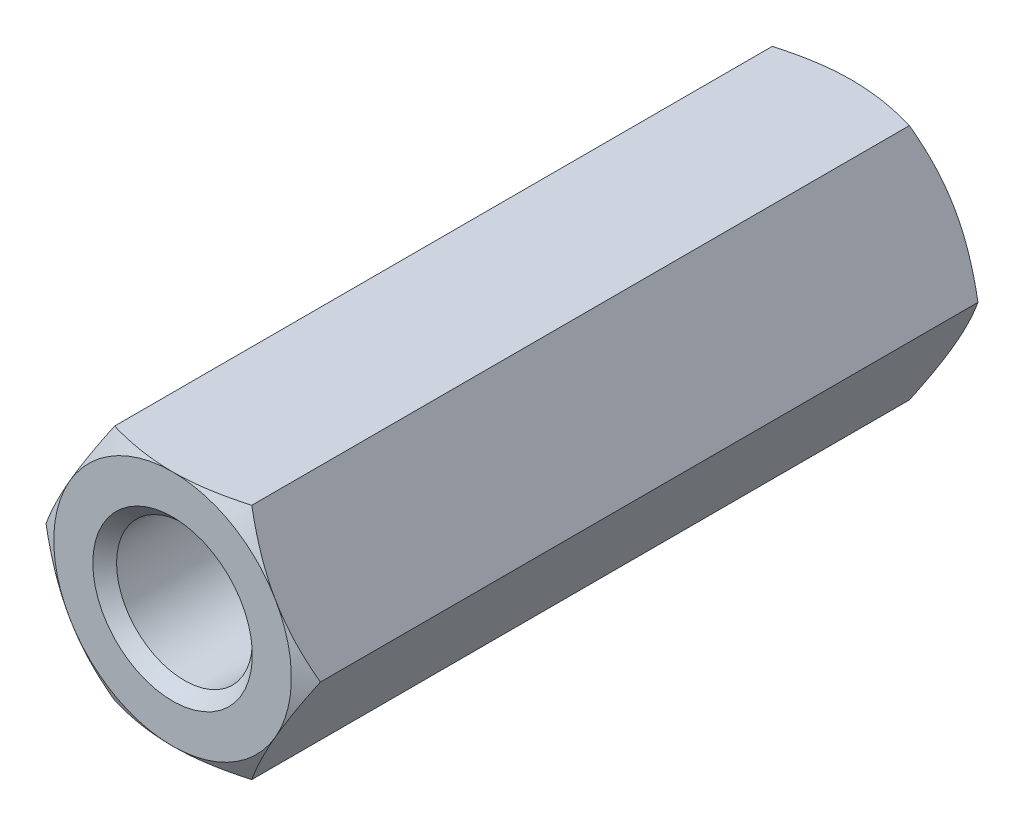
ISO-10303-21;
HEADER;
FILE_DESCRIPTION(('STEP AP214'),'2;1');
FILE_NAME('part.step','',(''),(''),'','','');
FILE_SCHEMA(('AUTOMOTIVE_DESIGN { 1 0 10303 214 1 1 1 1 }'));
ENDSEC;
DATA;
#1=APPLICATION_CONTEXT('core data for automotive mechanical design processes');
#2=APPLICATION_PROTOCOL_DEFINITION('international standard','automotive_design',2000,#1);
#3=PRODUCT_CONTEXT('',#1,'mechanical');
#4=PRODUCT('Part','Part','',(#3));
#5=PRODUCT_RELATED_PRODUCT_CATEGORY('part','',(#4));
#6=PRODUCT_DEFINITION_FORMATION('','',#4);
#7=PRODUCT_DEFINITION_CONTEXT('part definition',#1,'design');
#8=PRODUCT_DEFINITION('design','',#6,#7);
#9=PRODUCT_DEFINITION_SHAPE('','',#8);
#10=(LENGTH_UNIT() NAMED_UNIT(*) SI_UNIT(.MILLI.,.METRE.));
#11=(NAMED_UNIT(*) PLANE_ANGLE_UNIT() SI_UNIT($,.RADIAN.));
#12=(NAMED_UNIT(*) SI_UNIT($,.STERADIAN.) SOLID_ANGLE_UNIT());
#13=UNCERTAINTY_MEASURE_WITH_UNIT(LENGTH_MEASURE(1.E-05),#10,'distance_accuracy_value','');
#14=(GEOMETRIC_REPRESENTATION_CONTEXT(3) GLOBAL_UNCERTAINTY_ASSIGNED_CONTEXT((#13)) GLOBAL_UNIT_ASSIGNED_CONTEXT((#10,
#11,#12)) REPRESENTATION_CONTEXT('',''));
#15=CARTESIAN_POINT('',(0.,0.,0.));
#16=DIRECTION('',(0.,0.,1.));
#17=DIRECTION('',(1.,0.,0.));
#18=AXIS2_PLACEMENT_3D('',#15,#16,#17);
#19=CARTESIAN_POINT('',(4.04145188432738,0.,-10.));
#20=DIRECTION('',(0.866025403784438,0.5,0.));
#21=DIRECTION('',(-0.5,0.866025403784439,0.));
#22=AXIS2_PLACEMENT_3D('',#19,#20,#21);
#23=PLANE('',#22);
#24=CARTESIAN_POINT('',(4.04156735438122,-0.00019999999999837,9.68732593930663));
#25=CARTESIAN_POINT('',(3.9527667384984,0.153607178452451,9.73861421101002));
#26=CARTESIAN_POINT('',(3.86319960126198,0.308742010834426,9.78525904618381));
#27=CARTESIAN_POINT('',(3.68251437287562,0.621698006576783,9.86667812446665));
#28=CARTESIAN_POINT('',(3.59139307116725,0.779524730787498,9.90142356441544));
#29=CARTESIAN_POINT('',(3.41027974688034,1.09322221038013,9.95550997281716));
#30=CARTESIAN_POINT('',(3.32031559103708,1.24904469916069,9.97521091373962));
#31=CARTESIAN_POINT('',(3.13996396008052,1.56142288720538,9.99872986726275));
#32=CARTESIAN_POINT('',(3.04957714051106,1.71797745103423,10.0025673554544));
#33=CARTESIAN_POINT('',(2.88068384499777,2.01050921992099,9.99458469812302));
#34=CARTESIAN_POINT('',(2.80215208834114,2.14653021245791,9.98472456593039));
#35=CARTESIAN_POINT('',(2.64560020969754,2.417686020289,9.9534735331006));
#36=CARTESIAN_POINT('',(2.5675806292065,2.55281989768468,9.9320719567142));
#37=CARTESIAN_POINT('',(2.41070596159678,2.82453479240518,9.87856959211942));
#38=CARTESIAN_POINT('',(2.33187072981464,2.96108141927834,9.84624200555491));
#39=CARTESIAN_POINT('',(2.17537608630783,3.2321380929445,9.77287106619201));
#40=CARTESIAN_POINT('',(2.09771466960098,3.36665161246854,9.73184495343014));
#41=CARTESIAN_POINT('',(2.02061047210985,3.5002,9.68732593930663));
#42=B_SPLINE_CURVE_WITH_KNOTS('',3,(#24,#25,#26,#27,#28,#29,#30,#31,#32,#33,#34,#35,#36,#37,#38,
#39,#40,#41),.UNSPECIFIED.,.F.,.F.,(4,2,2,2,2,2,2,2,4),(0.,0.554793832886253,1.11092123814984,
1.65328467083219,2.19498204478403,2.6666513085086,3.13875761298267,3.62133612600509,
4.10296698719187),.UNSPECIFIED.);
#43=CARTESIAN_POINT('',(4.04145188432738,0.,9.68739260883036));
#44=VERTEX_POINT('',#43);
#45=CARTESIAN_POINT('',(3.03108891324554,1.75,10.));
#46=VERTEX_POINT('',#45);
#47=EDGE_CURVE('E127',#44,#46,#42,.T.);
#48=ORIENTED_EDGE('',*,*,#47,.F.);
#49=DIRECTION('',(0.,0.,1.));
#50=VECTOR('',#49,1.);
#51=CARTESIAN_POINT('',(4.04145188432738,0.,-10.));
#52=LINE('',#51,#50);
#53=CARTESIAN_POINT('',(4.04145188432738,0.,-9.68739260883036));
#54=VERTEX_POINT('',#53);
#55=EDGE_CURVE('E574',#54,#44,#52,.T.);
#56=ORIENTED_EDGE('',*,*,#55,.F.);
#57=CARTESIAN_POINT('',(4.04156735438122,-0.00019999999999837,-9.68732593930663));
#58=CARTESIAN_POINT('',(3.9527667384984,0.153607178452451,-9.73861421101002));
#59=CARTESIAN_POINT('',(3.86319960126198,0.308742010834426,-9.78525904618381));
#60=CARTESIAN_POINT('',(3.68251437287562,0.621698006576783,-9.86667812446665));
#61=CARTESIAN_POINT('',(3.59139307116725,0.779524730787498,-9.90142356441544));
#62=CARTESIAN_POINT('',(3.41027974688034,1.09322221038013,-9.95550997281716));
#63=CARTESIAN_POINT('',(3.32031559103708,1.24904469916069,-9.97521091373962));
#64=CARTESIAN_POINT('',(3.13996396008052,1.56142288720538,-9.99872986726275));
#65=CARTESIAN_POINT('',(3.04957714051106,1.71797745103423,-10.0025673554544));
#66=CARTESIAN_POINT('',(2.88068384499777,2.01050921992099,-9.99458469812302));
#67=CARTESIAN_POINT('',(2.80215208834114,2.14653021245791,-9.98472456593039));
#68=CARTESIAN_POINT('',(2.64560020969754,2.417686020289,-9.9534735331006));
#69=CARTESIAN_POINT('',(2.5675806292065,2.55281989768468,-9.9320719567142));
#70=CARTESIAN_POINT('',(2.41070596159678,2.82453479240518,-9.87856959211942));
#71=CARTESIAN_POINT('',(2.33187072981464,2.96108141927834,-9.84624200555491));
#72=CARTESIAN_POINT('',(2.17537608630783,3.2321380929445,-9.77287106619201));
#73=CARTESIAN_POINT('',(2.09771466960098,3.36665161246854,-9.73184495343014));
#74=CARTESIAN_POINT('',(2.02061047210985,3.5002,-9.68732593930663));
#75=B_SPLINE_CURVE_WITH_KNOTS('',3,(#57,#58,#59,#60,#61,#62,#63,#64,#65,#66,#67,#68,#69,#70,#71,
#72,#73,#74),.UNSPECIFIED.,.F.,.F.,(4,2,2,2,2,2,2,2,4),(0.,0.554793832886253,1.11092123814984,
1.65328467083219,2.19498204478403,2.6666513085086,3.13875761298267,3.62133612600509,
4.10296698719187),.UNSPECIFIED.);
#76=CARTESIAN_POINT('',(3.03108891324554,1.75,-10.));
#77=VERTEX_POINT('',#76);
#78=EDGE_CURVE('E545',#54,#77,#75,.T.);
#79=ORIENTED_EDGE('',*,*,#78,.T.);
#80=CARTESIAN_POINT('',(2.0207259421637,3.5,-9.68739260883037));
#81=VERTEX_POINT('',#80);
#82=EDGE_CURVE('E269',#77,#81,#75,.T.);
#83=ORIENTED_EDGE('',*,*,#82,.T.);
#84=DIRECTION('',(0.,0.,1.));
#85=VECTOR('',#84,1.);
#86=CARTESIAN_POINT('',(2.02072594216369,3.5,-10.));
#87=LINE('',#86,#85);
#88=CARTESIAN_POINT('',(2.02072594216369,3.5,9.68739260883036));
#89=VERTEX_POINT('',#88);
#90=EDGE_CURVE('E159',#81,#89,#87,.T.);
#91=ORIENTED_EDGE('',*,*,#90,.T.);
#92=EDGE_CURVE('E140',#46,#89,#42,.T.);
#93=ORIENTED_EDGE('',*,*,#92,.F.);
#94=EDGE_LOOP('',(#48,#56,#79,#83,#91,#93));
#95=FACE_BOUND('',#94,.T.);
#96=ADVANCED_FACE('F41',(#95),#23,.T.);
#97=CARTESIAN_POINT('',(2.02072594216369,-3.5,-10.));
#98=DIRECTION('',(0.866025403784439,-0.5,0.));
#99=DIRECTION('',(0.5,0.866025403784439,0.));
#100=AXIS2_PLACEMENT_3D('',#97,#98,#99);
#101=PLANE('',#100);
#102=CARTESIAN_POINT('',(2.02061047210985,-3.5002,9.68732593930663));
#103=CARTESIAN_POINT('',(2.10941108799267,-3.34639282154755,9.73861421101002));
#104=CARTESIAN_POINT('',(2.19897822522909,-3.19125798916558,9.78525904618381));
#105=CARTESIAN_POINT('',(2.37966345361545,-2.87830199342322,9.86667812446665));
#106=CARTESIAN_POINT('',(2.47078475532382,-2.7204752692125,9.90142356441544));
#107=CARTESIAN_POINT('',(2.65189807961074,-2.40677778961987,9.95550997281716));
#108=CARTESIAN_POINT('',(2.74186223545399,-2.25095530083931,9.97521091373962));
#109=CARTESIAN_POINT('',(2.92221386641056,-1.93857711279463,9.99872986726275));
#110=CARTESIAN_POINT('',(3.01260068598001,-1.78202254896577,10.0025673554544));
#111=CARTESIAN_POINT('',(3.1814939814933,-1.48949078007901,9.99458469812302));
#112=CARTESIAN_POINT('',(3.26002573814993,-1.35346978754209,9.98472456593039));
#113=CARTESIAN_POINT('',(3.41657761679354,-1.082313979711,9.9534735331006));
#114=CARTESIAN_POINT('',(3.49459719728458,-0.947180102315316,9.9320719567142));
#115=CARTESIAN_POINT('',(3.65147186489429,-0.675465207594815,9.87856959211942));
#116=CARTESIAN_POINT('',(3.73030709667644,-0.538918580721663,9.84624200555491));
#117=CARTESIAN_POINT('',(3.88680174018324,-0.267861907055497,9.77287106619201));
#118=CARTESIAN_POINT('',(3.96446315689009,-0.133348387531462,9.73184495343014));
#119=CARTESIAN_POINT('',(4.04156735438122,0.0002000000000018,9.68732593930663));
#120=B_SPLINE_CURVE_WITH_KNOTS('',3,(#102,#103,#104,#105,#106,#107,#108,#109,#110,#111,#112,
#113,#114,#115,#116,#117,#118,#119),.UNSPECIFIED.,.F.,.F.,(4,2,2,2,2,2,2,2,4),(0.,
0.554793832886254,1.11092123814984,1.65328467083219,2.19498204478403,2.6666513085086,
3.13875761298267,3.6213361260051,4.10296698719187),.UNSPECIFIED.);
#121=CARTESIAN_POINT('',(2.02072594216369,-3.5,9.68739260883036));
#122=VERTEX_POINT('',#121);
#123=CARTESIAN_POINT('',(3.03108891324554,-1.75,10.));
#124=VERTEX_POINT('',#123);
#125=EDGE_CURVE('E531',#122,#124,#120,.T.);
#126=ORIENTED_EDGE('',*,*,#125,.F.);
#127=DIRECTION('',(0.,0.,1.));
#128=VECTOR('',#127,1.);
#129=CARTESIAN_POINT('',(2.02072594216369,-3.5,-10.));
#130=LINE('',#129,#128);
#131=CARTESIAN_POINT('',(2.02072594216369,-3.5,-9.68739260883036));
#132=VERTEX_POINT('',#131);
#133=EDGE_CURVE('E283',#132,#122,#130,.T.);
#134=ORIENTED_EDGE('',*,*,#133,.F.);
#135=CARTESIAN_POINT('',(2.02061047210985,-3.5002,-9.68732593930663));
#136=CARTESIAN_POINT('',(2.10941108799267,-3.34639282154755,-9.73861421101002));
#137=CARTESIAN_POINT('',(2.19897822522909,-3.19125798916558,-9.78525904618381));
#138=CARTESIAN_POINT('',(2.37966345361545,-2.87830199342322,-9.86667812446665));
#139=CARTESIAN_POINT('',(2.47078475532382,-2.7204752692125,-9.90142356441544));
#140=CARTESIAN_POINT('',(2.65189807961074,-2.40677778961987,-9.95550997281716));
#141=CARTESIAN_POINT('',(2.74186223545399,-2.25095530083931,-9.97521091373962));
#142=CARTESIAN_POINT('',(2.92221386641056,-1.93857711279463,-9.99872986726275));
#143=CARTESIAN_POINT('',(3.01260068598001,-1.78202254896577,-10.0025673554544));
#144=CARTESIAN_POINT('',(3.1814939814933,-1.48949078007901,-9.99458469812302));
#145=CARTESIAN_POINT('',(3.26002573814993,-1.35346978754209,-9.98472456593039));
#146=CARTESIAN_POINT('',(3.41657761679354,-1.082313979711,-9.9534735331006));
#147=CARTESIAN_POINT('',(3.49459719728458,-0.947180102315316,-9.9320719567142));
#148=CARTESIAN_POINT('',(3.65147186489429,-0.675465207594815,-9.87856959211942));
#149=CARTESIAN_POINT('',(3.73030709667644,-0.538918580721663,-9.84624200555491));
#150=CARTESIAN_POINT('',(3.88680174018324,-0.267861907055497,-9.77287106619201));
#151=CARTESIAN_POINT('',(3.96446315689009,-0.133348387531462,-9.73184495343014));
#152=CARTESIAN_POINT('',(4.04156735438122,0.0002000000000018,-9.68732593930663));
#153=B_SPLINE_CURVE_WITH_KNOTS('',3,(#135,#136,#137,#138,#139,#140,#141,#142,#143,#144,#145,
#146,#147,#148,#149,#150,#151,#152),.UNSPECIFIED.,.F.,.F.,(4,2,2,2,2,2,2,2,4),(0.,
0.554793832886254,1.11092123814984,1.65328467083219,2.19498204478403,2.6666513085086,
3.13875761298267,3.6213361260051,4.10296698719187),.UNSPECIFIED.);
#154=CARTESIAN_POINT('',(3.03108891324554,-1.75,-10.));
#155=VERTEX_POINT('',#154);
#156=EDGE_CURVE('E558',#132,#155,#153,.T.);
#157=ORIENTED_EDGE('',*,*,#156,.T.);
#158=EDGE_CURVE('E284',#155,#54,#153,.T.);
#159=ORIENTED_EDGE('',*,*,#158,.T.);
#160=ORIENTED_EDGE('',*,*,#55,.T.);
#161=EDGE_CURVE('E132',#124,#44,#120,.T.);
#162=ORIENTED_EDGE('',*,*,#161,.F.);
#163=EDGE_LOOP('',(#126,#134,#157,#159,#160,#162));
#164=FACE_BOUND('',#163,.T.);
#165=ADVANCED_FACE('F254',(#164),#101,.T.);
#166=CARTESIAN_POINT('',(-2.02072594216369,-3.5,-10.));
#167=DIRECTION('',(0.,-1.,0.));
#168=DIRECTION('',(1.,0.,0.));
#169=AXIS2_PLACEMENT_3D('',#166,#167,#168);
#170=PLANE('',#169);
#171=CARTESIAN_POINT('',(-17.2493333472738,-3.50000000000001,1.85887734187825));
#172=CARTESIAN_POINT('',(-16.8755679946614,-3.50000000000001,2.07035492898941));
#173=CARTESIAN_POINT('',(-16.5016911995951,-3.50000000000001,2.28163590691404));
#174=CARTESIAN_POINT('',(-15.7536527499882,-3.50000000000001,2.70369523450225));
#175=CARTESIAN_POINT('',(-15.3794910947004,-3.50000000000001,2.91447358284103));
#176=CARTESIAN_POINT('',(-14.6307665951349,-3.50000000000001,3.33544879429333));
#177=CARTESIAN_POINT('',(-14.2562036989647,-3.50000000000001,3.54564556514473));
#178=CARTESIAN_POINT('',(-13.5066476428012,-3.50000000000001,3.96526978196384));
#179=CARTESIAN_POINT('',(-13.131654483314,-3.5,4.17469722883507));
#180=CARTESIAN_POINT('',(-12.3839028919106,-3.5,4.59102589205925));
#181=CARTESIAN_POINT('',(-12.0111484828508,-3.5,4.79793432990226));
#182=CARTESIAN_POINT('',(-11.2649484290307,-3.5,5.21050068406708));
#183=CARTESIAN_POINT('',(-10.891502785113,-3.5,5.41615860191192));
#184=CARTESIAN_POINT('',(-10.1437350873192,-3.5,5.82579807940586));
#185=CARTESIAN_POINT('',(-9.76941311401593,-3.5,6.02977978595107));
#186=CARTESIAN_POINT('',(-9.01954484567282,-3.5,6.43547610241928));
#187=CARTESIAN_POINT('',(-8.64399855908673,-3.5,6.63719072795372));
#188=CARTESIAN_POINT('',(-7.88391491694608,-3.5,7.04131580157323));
#189=CARTESIAN_POINT('',(-7.49934433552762,-3.5,7.24366401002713));
#190=CARTESIAN_POINT('',(-6.92053648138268,-3.5,7.54350002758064));
#191=CARTESIAN_POINT('',(-6.72725872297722,-3.5,7.6428392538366));
#192=CARTESIAN_POINT('',(-6.33991648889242,-3.5,7.83997044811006));
#193=CARTESIAN_POINT('',(-6.14585201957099,-3.5,7.93776242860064));
#194=CARTESIAN_POINT('',(-5.75545275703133,-3.5,8.13205108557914));
#195=CARTESIAN_POINT('',(-5.55911146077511,-3.5,8.22853472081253));
#196=CARTESIAN_POINT('',(-5.16521023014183,-3.5,8.41897649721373));
#197=CARTESIAN_POINT('',(-4.9676503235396,-3.5,8.51293469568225));
#198=CARTESIAN_POINT('',(-4.57103568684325,-3.5,8.69754530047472));
#199=CARTESIAN_POINT('',(-4.37198127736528,-3.5,8.78819839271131));
#200=CARTESIAN_POINT('',(-3.97194919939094,-3.5,8.96513835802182));
#201=CARTESIAN_POINT('',(-3.7709716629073,-3.5,9.051425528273));
#202=CARTESIAN_POINT('',(-3.34634779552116,-3.5,9.22646190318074));
#203=CARTESIAN_POINT('',(-3.12244434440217,-3.5,9.31459445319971));
#204=CARTESIAN_POINT('',(-2.67084578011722,-3.5,9.48083638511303));
#205=CARTESIAN_POINT('',(-2.44314982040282,-3.5,9.55894349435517));
#206=CARTESIAN_POINT('',(-1.98577507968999,-3.5,9.70006238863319));
#207=CARTESIAN_POINT('',(-1.75614723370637,-3.5,9.76323375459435));
#208=CARTESIAN_POINT('',(-1.40837578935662,-3.5,9.8433992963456));
#209=CARTESIAN_POINT('',(-1.29190939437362,-3.5,9.86768744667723));
#210=CARTESIAN_POINT('',(-1.0579581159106,-3.5,9.91067176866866));
#211=CARTESIAN_POINT('',(-0.94047345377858,-3.5,9.92936912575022));
#212=CARTESIAN_POINT('',(-0.724892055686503,-3.5,9.95784573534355));
#213=CARTESIAN_POINT('',(-0.626924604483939,-3.5,9.96860437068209));
#214=CARTESIAN_POINT('',(-0.430603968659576,-3.5,9.98553516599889));
#215=CARTESIAN_POINT('',(-0.332250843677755,-3.5,9.99170800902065));
#216=CARTESIAN_POINT('',(-0.135381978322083,-3.5,9.99928380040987));
#217=CARTESIAN_POINT('',(-0.0368662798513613,-3.5,10.0006878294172));
#218=CARTESIAN_POINT('',(0.160116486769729,-3.5,9.99868576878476));
#219=CARTESIAN_POINT('',(0.258583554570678,-3.5,9.99527964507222));
#220=CARTESIAN_POINT('',(0.455919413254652,-3.5,9.98372166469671));
#221=CARTESIAN_POINT('',(0.554786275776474,-3.5,9.97553716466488));
#222=CARTESIAN_POINT('',(0.752040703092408,-3.5,9.9546376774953));
#223=CARTESIAN_POINT('',(0.850428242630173,-3.5,9.94192245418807));
#224=CARTESIAN_POINT('',(1.04658574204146,-3.5,9.91230035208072));
#225=CARTESIAN_POINT('',(1.1443555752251,-3.5,9.89539264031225));
#226=CARTESIAN_POINT('',(1.33914811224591,-3.5,9.85778878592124));
#227=CARTESIAN_POINT('',(1.43617087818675,-3.5,9.83709296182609));
#228=CARTESIAN_POINT('',(1.70756474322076,-3.5,9.77423703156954));
#229=CARTESIAN_POINT('',(1.8810531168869,-3.5,9.72825100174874));
#230=CARTESIAN_POINT('',(2.22552235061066,-3.5,9.62762151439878));
#231=CARTESIAN_POINT('',(2.39650216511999,-3.5,9.57297455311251));
#232=CARTESIAN_POINT('',(2.73643123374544,-3.5,9.45692383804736));
#233=CARTESIAN_POINT('',(2.90537690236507,-3.5,9.39550967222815));
#234=CARTESIAN_POINT('',(3.24127228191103,-3.5,9.26755037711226));
#235=CARTESIAN_POINT('',(3.40822225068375,-3.5,9.20100591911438));
#236=CARTESIAN_POINT('',(3.74132599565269,-3.5,9.06359446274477));
#237=CARTESIAN_POINT('',(3.90747131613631,-3.5,8.99270707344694));
#238=CARTESIAN_POINT('',(4.238390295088,-3.5,8.84780237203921));
#239=CARTESIAN_POINT('',(4.40316392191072,-3.5,8.77378498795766));
#240=CARTESIAN_POINT('',(4.73143780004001,-3.5,8.62334730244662));
#241=CARTESIAN_POINT('',(4.89493901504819,-3.5,8.54692909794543));
#242=CARTESIAN_POINT('',(5.22100648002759,-3.5,8.39212053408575));
#243=CARTESIAN_POINT('',(5.38357271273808,-3.5,8.31373013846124));
#244=CARTESIAN_POINT('',(5.87610916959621,-3.5,8.07326366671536));
#245=CARTESIAN_POINT('',(6.20486472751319,-3.5,7.90870131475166));
#246=CARTESIAN_POINT('',(6.86020044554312,-3.5,7.5751822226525));
#247=CARTESIAN_POINT('',(7.18678019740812,-3.5,7.40622468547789));
#248=CARTESIAN_POINT('',(7.83734743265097,-3.5,7.06575471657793));
#249=CARTESIAN_POINT('',(8.16133976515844,-3.5,6.89425153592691));
#250=CARTESIAN_POINT('',(8.80812487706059,-3.5,6.54904437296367));
#251=CARTESIAN_POINT('',(9.13091772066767,-3.5,6.37534051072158));
#252=CARTESIAN_POINT('',(9.78524988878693,-3.5,6.02106398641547));
#253=CARTESIAN_POINT('',(10.116762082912,-3.5,5.84044126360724));
#254=CARTESIAN_POINT('',(10.7790582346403,-3.5,5.47786495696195));
#255=CARTESIAN_POINT('',(11.1098421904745,-3.5,5.29591136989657));
#256=CARTESIAN_POINT('',(12.1019985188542,-3.5,4.74816154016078));
#257=CARTESIAN_POINT('',(12.7625234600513,-3.5,4.38083088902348));
#258=CARTESIAN_POINT('',(14.0615671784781,-3.5,3.65508245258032));
#259=CARTESIAN_POINT('',(14.7001301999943,-3.5,3.29674369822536));
#260=CARTESIAN_POINT('',(15.6569534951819,-3.5,2.75816319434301));
#261=CARTESIAN_POINT('',(15.9755662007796,-3.5,2.57854721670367));
#262=CARTESIAN_POINT('',(16.6125912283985,-3.5,2.21896185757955));
#263=CARTESIAN_POINT('',(16.9310035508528,-3.5,2.03899247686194));
#264=CARTESIAN_POINT('',(17.2493333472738,-3.5,1.85887734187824));
#265=B_SPLINE_CURVE_WITH_KNOTS('',3,(#171,#172,#173,#174,#175,#176,#177,#178,#179,#180,#181,
#182,#183,#184,#185,#186,#187,#188,#189,#190,#191,#192,#193,#194,#195,#196,#197,#198,#199,#200,
#201,#202,#203,#204,#205,#206,#207,#208,#209,#210,#211,#212,#213,#214,#215,#216,#217,#218,#219,
#220,#221,#222,#223,#224,#225,#226,#227,#228,#229,#230,#231,#232,#233,#234,#235,#236,#237,#238,
#239,#240,#241,#242,#243,#244,#245,#246,#247,#248,#249,#250,#251,#252,#253,#254,#255,#256,#257,
#258,#259,#260,#261,#262,#263,#264),.UNSPECIFIED.,.F.,.F.,(4,2,2,2,2,2,2,2,2,2,2,2,2,2,2,2,2,2,
2,2,2,2,2,2,2,2,2,2,2,2,2,2,2,2,2,2,2,2,2,2,2,2,2,2,2,2,4),(0.,1.28833625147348,
2.57667589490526,3.8652093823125,5.15374135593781,6.43272840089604,7.71171388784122,
8.99058606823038,10.2694494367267,11.5730906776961,12.2250219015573,12.8769478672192,
13.5332349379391,14.1895071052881,14.8456422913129,15.5017327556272,16.2234316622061,
16.9452938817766,17.6590544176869,18.0158599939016,18.3725898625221,18.6681605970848,
18.9636872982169,19.259147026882,19.5546088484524,19.8521131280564,20.1496329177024,
20.4472118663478,20.7447658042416,21.2828837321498,21.8212199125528,22.3603962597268,
22.8995021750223,23.4413688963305,23.9832480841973,24.5246664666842,25.0660948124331,
26.1689649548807,27.272036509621,28.3717785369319,29.4714608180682,30.604030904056,
31.7366037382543,34.0039757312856,36.2006805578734,37.2979422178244,38.3952014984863),.UNSPECIFIED.);
#266=CARTESIAN_POINT('',(-2.02072594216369,-3.5,9.68739260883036));
#267=VERTEX_POINT('',#266);
#268=CARTESIAN_POINT('',(0.,-3.5,10.));
#269=VERTEX_POINT('',#268);
#270=EDGE_CURVE('E532',#267,#269,#265,.T.);
#271=ORIENTED_EDGE('',*,*,#270,.F.);
#272=DIRECTION('',(0.,0.,1.));
#273=VECTOR('',#272,1.);
#274=CARTESIAN_POINT('',(-2.02072594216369,-3.5,-10.));
#275=LINE('',#274,#273);
#276=CARTESIAN_POINT('',(-2.02072594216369,-3.5,-9.68739260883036));
#277=VERTEX_POINT('',#276);
#278=EDGE_CURVE('E544',#277,#267,#275,.T.);
#279=ORIENTED_EDGE('',*,*,#278,.F.);
#280=CARTESIAN_POINT('',(-10.7507738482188,-3.5,-5.49311437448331));
#281=CARTESIAN_POINT('',(-10.5126698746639,-3.5,-5.62382195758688));
#282=CARTESIAN_POINT('',(-10.2743971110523,-3.5,-5.75422337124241));
#283=CARTESIAN_POINT('',(-9.79742424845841,-3.5,-6.0142498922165));
#284=CARTESIAN_POINT('',(-9.55872414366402,-3.5,-6.1438749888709));
#285=CARTESIAN_POINT('',(-9.08067833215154,-3.5,-6.40225430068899));
#286=CARTESIAN_POINT('',(-8.84133233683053,-3.5,-6.53100798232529));
#287=CARTESIAN_POINT('',(-8.36201160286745,-3.5,-6.78733734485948));
#288=CARTESIAN_POINT('',(-8.12203686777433,-3.5,-6.9149130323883));
#289=CARTESIAN_POINT('',(-7.6360811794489,-3.5,-7.17133452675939));
#290=CARTESIAN_POINT('',(-7.39008299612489,-3.5,-7.30014772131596));
#291=CARTESIAN_POINT('',(-6.89704804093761,-3.5,-7.55577000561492));
#292=CARTESIAN_POINT('',(-6.65001127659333,-3.5,-7.68257910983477));
#293=CARTESIAN_POINT('',(-6.15465612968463,-3.5,-7.93352397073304));
#294=CARTESIAN_POINT('',(-5.90633807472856,-3.5,-8.05766037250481));
#295=CARTESIAN_POINT('',(-5.40795190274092,-3.5,-8.30236027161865));
#296=CARTESIAN_POINT('',(-5.15788384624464,-3.5,-8.42292389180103));
#297=CARTESIAN_POINT('',(-4.64929297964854,-3.5,-8.66197947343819));
#298=CARTESIAN_POINT('',(-4.39071255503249,-3.5,-8.78034953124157));
#299=CARTESIAN_POINT('',(-3.87015745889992,-3.5,-9.00964989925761));
#300=CARTESIAN_POINT('',(-3.60818190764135,-3.5,-9.12057823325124));
#301=CARTESIAN_POINT('',(-3.08089609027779,-3.5,-9.33088961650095));
#302=CARTESIAN_POINT('',(-2.81560515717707,-3.5,-9.43032054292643));
#303=CARTESIAN_POINT('',(-2.27929281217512,-3.5,-9.61253202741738));
#304=CARTESIAN_POINT('',(-2.00827391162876,-3.5,-9.69531972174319));
#305=CARTESIAN_POINT('',(-1.54282289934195,-3.5,-9.81459034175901));
#306=CARTESIAN_POINT('',(-1.35006631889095,-3.5,-9.85750298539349));
#307=CARTESIAN_POINT('',(-0.961730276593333,-3.5,-9.92780027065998));
#308=CARTESIAN_POINT('',(-0.766151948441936,-3.5,-9.95519097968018));
#309=CARTESIAN_POINT('',(-0.374300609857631,-3.5,-9.99152322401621));
#310=CARTESIAN_POINT('',(-0.17803708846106,-3.5,-10.0005638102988));
#311=CARTESIAN_POINT('',(0.214451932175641,-3.5,-9.99938150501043));
#312=CARTESIAN_POINT('',(0.410677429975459,-3.5,-9.98915798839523));
#313=CARTESIAN_POINT('',(0.73399280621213,-3.5,-9.9573376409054));
#314=CARTESIAN_POINT('',(0.861622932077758,-3.5,-9.94086914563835));
#315=CARTESIAN_POINT('',(1.1157982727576,-3.5,-9.90097185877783));
#316=CARTESIAN_POINT('',(1.24234333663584,-3.5,-9.87754211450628));
#317=CARTESIAN_POINT('',(1.62024456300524,-3.5,-9.79811364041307));
#318=CARTESIAN_POINT('',(1.86969580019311,-3.5,-9.73299473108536));
#319=CARTESIAN_POINT('',(2.24231826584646,-3.5,-9.62166992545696));
#320=CARTESIAN_POINT('',(2.36750184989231,-3.5,-9.58182091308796));
#321=CARTESIAN_POINT('',(2.61663244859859,-3.5,-9.49839474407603));
#322=CARTESIAN_POINT('',(2.74057945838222,-3.5,-9.4548175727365));
#323=CARTESIAN_POINT('',(2.98728700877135,-3.5,-9.36461508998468));
#324=CARTESIAN_POINT('',(3.1100480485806,-3.5,-9.31799113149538));
#325=CARTESIAN_POINT('',(3.35457324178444,-3.5,-9.2222085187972));
#326=CARTESIAN_POINT('',(3.47633740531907,-3.5,-9.1730498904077));
#327=CARTESIAN_POINT('',(3.75851776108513,-3.5,-9.05627784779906));
#328=CARTESIAN_POINT('',(3.918604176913,-3.5,-8.9878691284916));
#329=CARTESIAN_POINT('',(4.23750900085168,-3.5,-8.84815013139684));
#330=CARTESIAN_POINT('',(4.39632734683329,-3.5,-8.77683971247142));
#331=CARTESIAN_POINT('',(4.71293162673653,-3.5,-8.63190033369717));
#332=CARTESIAN_POINT('',(4.87071738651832,-3.5,-8.55827099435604));
#333=CARTESIAN_POINT('',(5.18540844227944,-3.5,-8.40915170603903));
#334=CARTESIAN_POINT('',(5.34231372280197,-3.5,-8.33366172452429));
#335=CARTESIAN_POINT('',(5.81219833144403,-3.5,-8.10481067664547));
#336=CARTESIAN_POINT('',(6.12407798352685,-3.5,-7.94919293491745));
#337=CARTESIAN_POINT('',(6.74576517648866,-3.5,-7.6338733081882));
#338=CARTESIAN_POINT('',(7.05557265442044,-3.5,-7.47417129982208));
#339=CARTESIAN_POINT('',(7.64897162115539,-3.5,-7.16473651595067));
#340=CARTESIAN_POINT('',(7.9326796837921,-3.5,-7.01522691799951));
#341=CARTESIAN_POINT('',(8.49912029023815,-3.5,-6.71435396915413));
#342=CARTESIAN_POINT('',(8.78185280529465,-3.5,-6.56299056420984));
#343=CARTESIAN_POINT('',(9.34596523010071,-3.5,-6.2591656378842));
#344=CARTESIAN_POINT('',(9.62734673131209,-3.5,-6.10670706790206));
#345=CARTESIAN_POINT('',(10.1894867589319,-3.5,-5.80067584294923));
#346=CARTESIAN_POINT('',(10.4702453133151,-3.5,-5.64710323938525));
#347=CARTESIAN_POINT('',(10.7507738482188,-3.5,-5.49311437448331));
#348=B_SPLINE_CURVE_WITH_KNOTS('',3,(#280,#281,#282,#283,#284,#285,#286,#287,#288,#289,#290,
#291,#292,#293,#294,#295,#296,#297,#298,#299,#300,#301,#302,#303,#304,#305,#306,#307,#308,#309,
#310,#311,#312,#313,#314,#315,#316,#317,#318,#319,#320,#321,#322,#323,#324,#325,#326,#327,#328,
#329,#330,#331,#332,#333,#334,#335,#336,#337,#338,#339,#340,#341,#342,#343,#344,#345,#346,#347),
.UNSPECIFIED.,.F.,.F.,(4,2,2,2,2,2,2,2,2,2,2,2,2,2,2,2,2,2,2,2,2,2,2,2,2,2,2,2,2,2,2,2,2,4),(0.,
0.814863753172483,1.62973867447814,2.44507408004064,3.26040489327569,4.09344743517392,
4.92648395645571,5.75931710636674,6.59212158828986,7.44520212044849,8.2985083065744,
9.14812242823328,9.99737147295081,10.5893043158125,11.1810056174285,11.7695044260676,
12.3580223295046,12.7438949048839,13.1298203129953,13.9021847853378,14.2962763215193,
14.6903694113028,15.0842886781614,15.478203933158,16.0004361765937,16.5226938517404,
17.0450374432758,17.5673901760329,18.6129831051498,19.6586076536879,20.6206746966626,
21.5827698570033,22.5428569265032,23.5028999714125),.UNSPECIFIED.);
#349=CARTESIAN_POINT('',(0.,-3.5,-10.));
#350=VERTEX_POINT('',#349);
#351=EDGE_CURVE('E568',#277,#350,#348,.T.);
#352=ORIENTED_EDGE('',*,*,#351,.T.);
#353=EDGE_CURVE('E259',#350,#132,#348,.T.);
#354=ORIENTED_EDGE('',*,*,#353,.T.);
#355=ORIENTED_EDGE('',*,*,#133,.T.);
#356=EDGE_CURVE('E138',#269,#122,#265,.T.);
#357=ORIENTED_EDGE('',*,*,#356,.F.);
#358=EDGE_LOOP('',(#271,#279,#352,#354,#355,#357));
#359=FACE_BOUND('',#358,.T.);
#360=ADVANCED_FACE('F292',(#359),#170,.T.);
#361=CARTESIAN_POINT('',(-4.04145188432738,0.,-10.));
#362=DIRECTION('',(-0.866025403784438,-0.5,0.));
#363=DIRECTION('',(0.5,-0.866025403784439,0.));
#364=AXIS2_PLACEMENT_3D('',#361,#362,#363);
#365=PLANE('',#364);
#366=CARTESIAN_POINT('',(-4.04156735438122,0.000199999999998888,9.68732593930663));
#367=CARTESIAN_POINT('',(-3.9527667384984,-0.15360717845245,9.73861421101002));
#368=CARTESIAN_POINT('',(-3.86319960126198,-0.308742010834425,9.78525904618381));
#369=CARTESIAN_POINT('',(-3.68251437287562,-0.621698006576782,9.86667812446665));
#370=CARTESIAN_POINT('',(-3.59139307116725,-0.779524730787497,9.90142356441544));
#371=CARTESIAN_POINT('',(-3.41027974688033,-1.09322221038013,9.95550997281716));
#372=CARTESIAN_POINT('',(-3.32031559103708,-1.24904469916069,9.97521091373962));
#373=CARTESIAN_POINT('',(-3.13996396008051,-1.56142288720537,9.99872986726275));
#374=CARTESIAN_POINT('',(-3.04957714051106,-1.71797745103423,10.0025673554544));
#375=CARTESIAN_POINT('',(-2.88068384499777,-2.01050921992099,9.99458469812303));
#376=CARTESIAN_POINT('',(-2.80215208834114,-2.14653021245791,9.9847245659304));
#377=CARTESIAN_POINT('',(-2.64560020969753,-2.417686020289,9.9534735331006));
#378=CARTESIAN_POINT('',(-2.56758062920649,-2.55281989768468,9.9320719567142));
#379=CARTESIAN_POINT('',(-2.41070596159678,-2.82453479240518,9.87856959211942));
#380=CARTESIAN_POINT('',(-2.33187072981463,-2.96108141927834,9.84624200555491));
#381=CARTESIAN_POINT('',(-2.17537608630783,-3.2321380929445,9.77287106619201));
#382=CARTESIAN_POINT('',(-2.09771466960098,-3.36665161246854,9.73184495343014));
#383=CARTESIAN_POINT('',(-2.02061047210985,-3.5002,9.68732593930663));
#384=B_SPLINE_CURVE_WITH_KNOTS('',3,(#366,#367,#368,#369,#370,#371,#372,#373,#374,#375,#376,
#377,#378,#379,#380,#381,#382,#383),.UNSPECIFIED.,.F.,.F.,(4,2,2,2,2,2,2,2,4),(0.,
0.554793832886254,1.11092123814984,1.65328467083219,2.19498204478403,2.6666513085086,
3.13875761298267,3.6213361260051,4.10296698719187),.UNSPECIFIED.);
#385=CARTESIAN_POINT('',(-4.04145188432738,0.,9.68739260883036));
#386=VERTEX_POINT('',#385);
#387=CARTESIAN_POINT('',(-3.03108891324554,-1.75,10.));
#388=VERTEX_POINT('',#387);
#389=EDGE_CURVE('E176',#386,#388,#384,.T.);
#390=ORIENTED_EDGE('',*,*,#389,.F.);
#391=DIRECTION('',(0.,0.,1.));
#392=VECTOR('',#391,1.);
#393=CARTESIAN_POINT('',(-4.04145188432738,0.,-10.));
#394=LINE('',#393,#392);
#395=CARTESIAN_POINT('',(-4.04145188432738,0.,-9.68739260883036));
#396=VERTEX_POINT('',#395);
#397=EDGE_CURVE('E566',#396,#386,#394,.T.);
#398=ORIENTED_EDGE('',*,*,#397,.F.);
#399=CARTESIAN_POINT('',(-4.04156735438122,0.000199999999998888,-9.68732593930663));
#400=CARTESIAN_POINT('',(-3.9527667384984,-0.15360717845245,-9.73861421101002));
#401=CARTESIAN_POINT('',(-3.86319960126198,-0.308742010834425,-9.78525904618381));
#402=CARTESIAN_POINT('',(-3.68251437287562,-0.621698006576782,-9.86667812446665));
#403=CARTESIAN_POINT('',(-3.59139307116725,-0.779524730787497,-9.90142356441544));
#404=CARTESIAN_POINT('',(-3.41027974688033,-1.09322221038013,-9.95550997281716));
#405=CARTESIAN_POINT('',(-3.32031559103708,-1.24904469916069,-9.97521091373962));
#406=CARTESIAN_POINT('',(-3.13996396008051,-1.56142288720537,-9.99872986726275));
#407=CARTESIAN_POINT('',(-3.04957714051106,-1.71797745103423,-10.0025673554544));
#408=CARTESIAN_POINT('',(-2.88068384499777,-2.01050921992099,-9.99458469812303));
#409=CARTESIAN_POINT('',(-2.80215208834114,-2.14653021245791,-9.9847245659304));
#410=CARTESIAN_POINT('',(-2.64560020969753,-2.417686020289,-9.9534735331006));
#411=CARTESIAN_POINT('',(-2.56758062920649,-2.55281989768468,-9.9320719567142));
#412=CARTESIAN_POINT('',(-2.41070596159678,-2.82453479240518,-9.87856959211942));
#413=CARTESIAN_POINT('',(-2.33187072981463,-2.96108141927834,-9.84624200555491));
#414=CARTESIAN_POINT('',(-2.17537608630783,-3.2321380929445,-9.77287106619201));
#415=CARTESIAN_POINT('',(-2.09771466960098,-3.36665161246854,-9.73184495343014));
#416=CARTESIAN_POINT('',(-2.02061047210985,-3.5002,-9.68732593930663));
#417=B_SPLINE_CURVE_WITH_KNOTS('',3,(#399,#400,#401,#402,#403,#404,#405,#406,#407,#408,#409,
#410,#411,#412,#413,#414,#415,#416),.UNSPECIFIED.,.F.,.F.,(4,2,2,2,2,2,2,2,4),(0.,
0.554793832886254,1.11092123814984,1.65328467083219,2.19498204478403,2.6666513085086,
3.13875761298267,3.6213361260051,4.10296698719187),.UNSPECIFIED.);
#418=CARTESIAN_POINT('',(-3.03108891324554,-1.75,-10.));
#419=VERTEX_POINT('',#418);
#420=EDGE_CURVE('E275',#396,#419,#417,.T.);
#421=ORIENTED_EDGE('',*,*,#420,.T.);
#422=EDGE_CURVE('E282',#419,#277,#417,.T.);
#423=ORIENTED_EDGE('',*,*,#422,.T.);
#424=ORIENTED_EDGE('',*,*,#278,.T.);
#425=EDGE_CURVE('E599',#388,#267,#384,.T.);
#426=ORIENTED_EDGE('',*,*,#425,.F.);
#427=EDGE_LOOP('',(#390,#398,#421,#423,#424,#426));
#428=FACE_BOUND('',#427,.T.);
#429=ADVANCED_FACE('F289',(#428),#365,.T.);
#430=CARTESIAN_POINT('',(-2.02072594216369,3.5,-10.));
#431=DIRECTION('',(-0.866025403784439,0.5,0.));
#432=DIRECTION('',(-0.5,-0.866025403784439,0.));
#433=AXIS2_PLACEMENT_3D('',#430,#431,#432);
#434=PLANE('',#433);
#435=CARTESIAN_POINT('',(-2.02061047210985,3.5002,9.68732593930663));
#436=CARTESIAN_POINT('',(-2.10941108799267,3.34639282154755,9.73861421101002));
#437=CARTESIAN_POINT('',(-2.19897822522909,3.19125798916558,9.78525904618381));
#438=CARTESIAN_POINT('',(-2.37966345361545,2.87830199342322,9.86667812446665));
#439=CARTESIAN_POINT('',(-2.47078475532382,2.7204752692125,9.90142356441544));
#440=CARTESIAN_POINT('',(-2.65189807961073,2.40677778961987,9.95550997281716));
#441=CARTESIAN_POINT('',(-2.74186223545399,2.25095530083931,9.97521091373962));
#442=CARTESIAN_POINT('',(-2.92221386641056,1.93857711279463,9.99872986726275));
#443=CARTESIAN_POINT('',(-3.01260068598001,1.78202254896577,10.0025673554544));
#444=CARTESIAN_POINT('',(-3.1814939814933,1.48949078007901,9.99458469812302));
#445=CARTESIAN_POINT('',(-3.26002573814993,1.35346978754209,9.9847245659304));
#446=CARTESIAN_POINT('',(-3.41657761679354,1.082313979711,9.9534735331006));
#447=CARTESIAN_POINT('',(-3.49459719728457,0.947180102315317,9.9320719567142));
#448=CARTESIAN_POINT('',(-3.65147186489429,0.675465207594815,9.87856959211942));
#449=CARTESIAN_POINT('',(-3.73030709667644,0.538918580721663,9.84624200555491));
#450=CARTESIAN_POINT('',(-3.88680174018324,0.267861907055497,9.77287106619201));
#451=CARTESIAN_POINT('',(-3.96446315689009,0.133348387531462,9.73184495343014));
#452=CARTESIAN_POINT('',(-4.04156735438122,-0.000200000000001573,9.68732593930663));
#453=B_SPLINE_CURVE_WITH_KNOTS('',3,(#435,#436,#437,#438,#439,#440,#441,#442,#443,#444,#445,
#446,#447,#448,#449,#450,#451,#452),.UNSPECIFIED.,.F.,.F.,(4,2,2,2,2,2,2,2,4),(0.,
0.554793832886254,1.11092123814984,1.65328467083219,2.19498204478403,2.6666513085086,
3.13875761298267,3.6213361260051,4.10296698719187),.UNSPECIFIED.);
#454=CARTESIAN_POINT('',(-2.02072594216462,3.5,9.68739260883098));
#455=VERTEX_POINT('',#454);
#456=CARTESIAN_POINT('',(-3.03108891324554,1.75,10.));
#457=VERTEX_POINT('',#456);
#458=EDGE_CURVE('E183',#455,#457,#453,.T.);
#459=ORIENTED_EDGE('',*,*,#458,.F.);
#460=DIRECTION('',(0.,0.,1.));
#461=VECTOR('',#460,1.);
#462=CARTESIAN_POINT('',(-2.02072594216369,3.5,-10.));
#463=LINE('',#462,#461);
#464=CARTESIAN_POINT('',(-2.02072594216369,3.5,-9.68739260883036));
#465=VERTEX_POINT('',#464);
#466=EDGE_CURVE('E233',#465,#455,#463,.T.);
#467=ORIENTED_EDGE('',*,*,#466,.F.);
#468=CARTESIAN_POINT('',(-2.02061047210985,3.5002,-9.68732593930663));
#469=CARTESIAN_POINT('',(-2.10941108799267,3.34639282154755,-9.73861421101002));
#470=CARTESIAN_POINT('',(-2.19897822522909,3.19125798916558,-9.78525904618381));
#471=CARTESIAN_POINT('',(-2.37966345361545,2.87830199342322,-9.86667812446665));
#472=CARTESIAN_POINT('',(-2.47078475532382,2.7204752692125,-9.90142356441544));
#473=CARTESIAN_POINT('',(-2.65189807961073,2.40677778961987,-9.95550997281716));
#474=CARTESIAN_POINT('',(-2.74186223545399,2.25095530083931,-9.97521091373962));
#475=CARTESIAN_POINT('',(-2.92221386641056,1.93857711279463,-9.99872986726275));
#476=CARTESIAN_POINT('',(-3.01260068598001,1.78202254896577,-10.0025673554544));
#477=CARTESIAN_POINT('',(-3.1814939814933,1.48949078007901,-9.99458469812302));
#478=CARTESIAN_POINT('',(-3.26002573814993,1.35346978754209,-9.9847245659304));
#479=CARTESIAN_POINT('',(-3.41657761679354,1.082313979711,-9.9534735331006));
#480=CARTESIAN_POINT('',(-3.49459719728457,0.947180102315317,-9.9320719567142));
#481=CARTESIAN_POINT('',(-3.65147186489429,0.675465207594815,-9.87856959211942));
#482=CARTESIAN_POINT('',(-3.73030709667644,0.538918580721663,-9.84624200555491));
#483=CARTESIAN_POINT('',(-3.88680174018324,0.267861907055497,-9.77287106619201));
#484=CARTESIAN_POINT('',(-3.96446315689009,0.133348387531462,-9.73184495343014));
#485=CARTESIAN_POINT('',(-4.04156735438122,-0.000200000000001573,-9.68732593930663));
#486=B_SPLINE_CURVE_WITH_KNOTS('',3,(#468,#469,#470,#471,#472,#473,#474,#475,#476,#477,#478,
#479,#480,#481,#482,#483,#484,#485),.UNSPECIFIED.,.F.,.F.,(4,2,2,2,2,2,2,2,4),(0.,
0.554793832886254,1.11092123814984,1.65328467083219,2.19498204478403,2.6666513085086,
3.13875761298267,3.6213361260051,4.10296698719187),.UNSPECIFIED.);
#487=CARTESIAN_POINT('',(-3.03108891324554,1.75,-10.));
#488=VERTEX_POINT('',#487);
#489=EDGE_CURVE('E237',#465,#488,#486,.T.);
#490=ORIENTED_EDGE('',*,*,#489,.T.);
#491=EDGE_CURVE('E563',#488,#396,#486,.T.);
#492=ORIENTED_EDGE('',*,*,#491,.T.);
#493=ORIENTED_EDGE('',*,*,#397,.T.);
#494=EDGE_CURVE('E534',#457,#386,#453,.T.);
#495=ORIENTED_EDGE('',*,*,#494,.F.);
#496=EDGE_LOOP('',(#459,#467,#490,#492,#493,#495));
#497=FACE_BOUND('',#496,.T.);
#498=ADVANCED_FACE('F218',(#497),#434,.T.);
#499=CARTESIAN_POINT('',(2.02072594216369,3.5,-10.));
#500=DIRECTION('',(0.,1.,0.));
#501=DIRECTION('',(0.,0.,1.));
#502=AXIS2_PLACEMENT_3D('',#499,#500,#501);
#503=PLANE('',#502);
#504=CARTESIAN_POINT('',(17.2493333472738,3.5,1.85887734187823));
#505=CARTESIAN_POINT('',(16.8755679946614,3.5,2.0703549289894));
#506=CARTESIAN_POINT('',(16.5016911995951,3.5,2.28163590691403));
#507=CARTESIAN_POINT('',(15.7536527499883,3.5,2.70369523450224));
#508=CARTESIAN_POINT('',(15.3794910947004,3.5,2.91447358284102));
#509=CARTESIAN_POINT('',(14.6307665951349,3.5,3.33544879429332));
#510=CARTESIAN_POINT('',(14.2562036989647,3.5,3.54564556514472));
#511=CARTESIAN_POINT('',(13.5066476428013,3.5,3.96526978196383));
#512=CARTESIAN_POINT('',(13.131654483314,3.5,4.17469722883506));
#513=CARTESIAN_POINT('',(12.3839028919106,3.5,4.59102589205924));
#514=CARTESIAN_POINT('',(12.0111484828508,3.5,4.79793432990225));
#515=CARTESIAN_POINT('',(11.2649484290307,3.5,5.21050068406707));
#516=CARTESIAN_POINT('',(10.891502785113,3.5,5.41615860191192));
#517=CARTESIAN_POINT('',(10.1437350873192,3.5,5.82579807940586));
#518=CARTESIAN_POINT('',(9.76941311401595,3.5,6.02977978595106));
#519=CARTESIAN_POINT('',(9.01954484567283,3.5,6.43547610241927));
#520=CARTESIAN_POINT('',(8.64399855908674,3.5,6.63719072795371));
#521=CARTESIAN_POINT('',(7.88391491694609,3.5,7.04131580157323));
#522=CARTESIAN_POINT('',(7.49934433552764,3.5,7.24366401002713));
#523=CARTESIAN_POINT('',(6.92053648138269,3.5,7.54350002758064));
#524=CARTESIAN_POINT('',(6.72725872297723,3.5,7.64283925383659));
#525=CARTESIAN_POINT('',(6.33991648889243,3.5,7.83997044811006));
#526=CARTESIAN_POINT('',(6.145852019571,3.5,7.93776242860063));
#527=CARTESIAN_POINT('',(5.75545275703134,3.5,8.13205108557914));
#528=CARTESIAN_POINT('',(5.55911146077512,3.5,8.22853472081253));
#529=CARTESIAN_POINT('',(5.16521023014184,3.5,8.41897649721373));
#530=CARTESIAN_POINT('',(4.96765032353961,3.5,8.51293469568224));
#531=CARTESIAN_POINT('',(4.57103568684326,3.5,8.69754530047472));
#532=CARTESIAN_POINT('',(4.37198127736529,3.5,8.78819839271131));
#533=CARTESIAN_POINT('',(3.97194919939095,3.5,8.96513835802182));
#534=CARTESIAN_POINT('',(3.7709716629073,3.5,9.051425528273));
#535=CARTESIAN_POINT('',(3.34634779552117,3.5,9.22646190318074));
#536=CARTESIAN_POINT('',(3.12244434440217,3.5,9.31459445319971));
#537=CARTESIAN_POINT('',(2.67084578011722,3.5,9.48083638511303));
#538=CARTESIAN_POINT('',(2.44314982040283,3.5,9.55894349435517));
#539=CARTESIAN_POINT('',(1.98577507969,3.5,9.70006238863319));
#540=CARTESIAN_POINT('',(1.75614723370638,3.5,9.76323375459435));
#541=CARTESIAN_POINT('',(1.40837578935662,3.5,9.8433992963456));
#542=CARTESIAN_POINT('',(1.29190939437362,3.5,9.86768744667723));
#543=CARTESIAN_POINT('',(1.0579581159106,3.5,9.91067176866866));
#544=CARTESIAN_POINT('',(0.940473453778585,3.5,9.92936912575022));
#545=CARTESIAN_POINT('',(0.724892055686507,3.5,9.95784573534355));
#546=CARTESIAN_POINT('',(0.626924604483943,3.5,9.96860437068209));
#547=CARTESIAN_POINT('',(0.43060396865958,3.5,9.98553516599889));
#548=CARTESIAN_POINT('',(0.332250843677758,3.5,9.99170800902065));
#549=CARTESIAN_POINT('',(0.135381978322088,3.5,9.99928380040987));
#550=CARTESIAN_POINT('',(0.036866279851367,3.5,10.0006878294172));
#551=CARTESIAN_POINT('',(-0.160116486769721,3.5,9.99868576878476));
#552=CARTESIAN_POINT('',(-0.25858355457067,3.5,9.99527964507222));
#553=CARTESIAN_POINT('',(-0.455919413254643,3.5,9.98372166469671));
#554=CARTESIAN_POINT('',(-0.554786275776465,3.5,9.97553716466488));
#555=CARTESIAN_POINT('',(-0.7520407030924,3.5,9.9546376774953));
#556=CARTESIAN_POINT('',(-0.850428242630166,3.5,9.94192245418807));
#557=CARTESIAN_POINT('',(-1.04658574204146,3.5,9.91230035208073));
#558=CARTESIAN_POINT('',(-1.1443555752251,3.5,9.89539264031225));
#559=CARTESIAN_POINT('',(-1.33914811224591,3.5,9.85778878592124));
#560=CARTESIAN_POINT('',(-1.43617087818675,3.5,9.83709296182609));
#561=CARTESIAN_POINT('',(-1.70756474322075,3.5,9.77423703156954));
#562=CARTESIAN_POINT('',(-1.88105311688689,3.5,9.72825100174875));
#563=CARTESIAN_POINT('',(-2.22552235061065,3.5,9.62762151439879));
#564=CARTESIAN_POINT('',(-2.39650216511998,3.5,9.57297455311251));
#565=CARTESIAN_POINT('',(-2.73643123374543,3.5,9.45692383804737));
#566=CARTESIAN_POINT('',(-2.90537690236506,3.5,9.39550967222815));
#567=CARTESIAN_POINT('',(-3.24127228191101,3.5,9.26755037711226));
#568=CARTESIAN_POINT('',(-3.40822225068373,3.5,9.20100591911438));
#569=CARTESIAN_POINT('',(-3.74132599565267,3.5,9.06359446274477));
#570=CARTESIAN_POINT('',(-3.90747131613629,3.5,8.99270707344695));
#571=CARTESIAN_POINT('',(-4.23839029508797,3.5,8.84780237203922));
#572=CARTESIAN_POINT('',(-4.4031639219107,3.5,8.77378498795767));
#573=CARTESIAN_POINT('',(-4.73143780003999,3.5,8.62334730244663));
#574=CARTESIAN_POINT('',(-4.89493901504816,3.5,8.54692909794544));
#575=CARTESIAN_POINT('',(-5.22100648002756,3.5,8.39212053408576));
#576=CARTESIAN_POINT('',(-5.38357271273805,3.5,8.31373013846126));
#577=CARTESIAN_POINT('',(-5.87610916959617,3.5,8.07326366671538));
#578=CARTESIAN_POINT('',(-6.20486472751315,3.5,7.90870131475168));
#579=CARTESIAN_POINT('',(-6.86020044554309,3.5,7.57518222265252));
#580=CARTESIAN_POINT('',(-7.18678019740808,3.5,7.40622468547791));
#581=CARTESIAN_POINT('',(-7.83734743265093,3.5,7.06575471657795));
#582=CARTESIAN_POINT('',(-8.16133976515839,3.5,6.89425153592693));
#583=CARTESIAN_POINT('',(-8.80812487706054,3.5,6.5490443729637));
#584=CARTESIAN_POINT('',(-9.13091772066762,3.5,6.37534051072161));
#585=CARTESIAN_POINT('',(-9.78524988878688,3.5,6.0210639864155));
#586=CARTESIAN_POINT('',(-10.1167620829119,3.5,5.84044126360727));
#587=CARTESIAN_POINT('',(-10.7790582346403,3.5,5.47786495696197));
#588=CARTESIAN_POINT('',(-11.1098421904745,3.5,5.2959113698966));
#589=CARTESIAN_POINT('',(-12.1019985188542,3.5,4.7481615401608));
#590=CARTESIAN_POINT('',(-12.7625234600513,3.5,4.38083088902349));
#591=CARTESIAN_POINT('',(-14.0615671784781,3.5,3.65508245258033));
#592=CARTESIAN_POINT('',(-14.7001301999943,3.5,3.29674369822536));
#593=CARTESIAN_POINT('',(-15.6569534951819,3.5,2.75816319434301));
#594=CARTESIAN_POINT('',(-15.9755662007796,3.5,2.57854721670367));
#595=CARTESIAN_POINT('',(-16.6125912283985,3.5,2.21896185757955));
#596=CARTESIAN_POINT('',(-16.9310035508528,3.5,2.03899247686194));
#597=CARTESIAN_POINT('',(-17.2493333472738,3.5,1.85887734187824));
#598=B_SPLINE_CURVE_WITH_KNOTS('',3,(#504,#505,#506,#507,#508,#509,#510,#511,#512,#513,#514,
#515,#516,#517,#518,#519,#520,#521,#522,#523,#524,#525,#526,#527,#528,#529,#530,#531,#532,#533,
#534,#535,#536,#537,#538,#539,#540,#541,#542,#543,#544,#545,#546,#547,#548,#549,#550,#551,#552,
#553,#554,#555,#556,#557,#558,#559,#560,#561,#562,#563,#564,#565,#566,#567,#568,#569,#570,#571,
#572,#573,#574,#575,#576,#577,#578,#579,#580,#581,#582,#583,#584,#585,#586,#587,#588,#589,#590,
#591,#592,#593,#594,#595,#596,#597),.UNSPECIFIED.,.F.,.F.,(4,2,2,2,2,2,2,2,2,2,2,2,2,2,2,2,2,2,
2,2,2,2,2,2,2,2,2,2,2,2,2,2,2,2,2,2,2,2,2,2,2,2,2,2,2,2,4),(0.,1.28833625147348,
2.57667589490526,3.86520938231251,5.15374135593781,6.43272840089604,7.71171388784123,
8.99058606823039,10.2694494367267,11.5730906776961,12.2250219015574,12.8769478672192,
13.5332349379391,14.1895071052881,14.8456422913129,15.5017327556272,16.2234316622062,
16.9452938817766,17.6590544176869,18.0158599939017,18.3725898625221,18.6681605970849,
18.9636872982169,19.259147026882,19.5546088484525,19.8521131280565,20.1496329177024,
20.4472118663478,20.7447658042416,21.2828837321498,21.8212199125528,22.3603962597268,
22.8995021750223,23.4413688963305,23.9832480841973,24.5246664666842,25.066094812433,
26.1689649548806,27.272036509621,28.3717785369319,29.4714608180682,30.604030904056,
31.7366037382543,34.0039757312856,36.2006805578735,37.2979422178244,38.3952014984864),.UNSPECIFIED.);
#599=CARTESIAN_POINT('',(0.,3.5,10.));
#600=VERTEX_POINT('',#599);
#601=EDGE_CURVE('E145',#89,#600,#598,.T.);
#602=ORIENTED_EDGE('',*,*,#601,.F.);
#603=ORIENTED_EDGE('',*,*,#90,.F.);
#604=CARTESIAN_POINT('',(10.7507738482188,3.5,-5.49311437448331));
#605=CARTESIAN_POINT('',(10.5126698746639,3.5,-5.62382195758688));
#606=CARTESIAN_POINT('',(10.2743971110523,3.5,-5.75422337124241));
#607=CARTESIAN_POINT('',(9.79742424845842,3.5,-6.0142498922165));
#608=CARTESIAN_POINT('',(9.55872414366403,3.5,-6.1438749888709));
#609=CARTESIAN_POINT('',(9.08067833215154,3.5,-6.40225430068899));
#610=CARTESIAN_POINT('',(8.84133233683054,3.5,-6.53100798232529));
#611=CARTESIAN_POINT('',(8.36201160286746,3.5,-6.78733734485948));
#612=CARTESIAN_POINT('',(8.12203686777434,3.5,-6.9149130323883));
#613=CARTESIAN_POINT('',(7.6360811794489,3.5,-7.17133452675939));
#614=CARTESIAN_POINT('',(7.39008299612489,3.5,-7.30014772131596));
#615=CARTESIAN_POINT('',(6.89704804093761,3.5,-7.55577000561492));
#616=CARTESIAN_POINT('',(6.65001127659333,3.5,-7.68257910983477));
#617=CARTESIAN_POINT('',(6.15465612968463,3.5,-7.93352397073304));
#618=CARTESIAN_POINT('',(5.90633807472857,3.5,-8.05766037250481));
#619=CARTESIAN_POINT('',(5.40795190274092,3.5,-8.30236027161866));
#620=CARTESIAN_POINT('',(5.15788384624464,3.5,-8.42292389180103));
#621=CARTESIAN_POINT('',(4.64929297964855,3.5,-8.66197947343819));
#622=CARTESIAN_POINT('',(4.39071255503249,3.5,-8.78034953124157));
#623=CARTESIAN_POINT('',(3.87015745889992,3.5,-9.00964989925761));
#624=CARTESIAN_POINT('',(3.60818190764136,3.5,-9.12057823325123));
#625=CARTESIAN_POINT('',(3.08089609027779,3.5,-9.33088961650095));
#626=CARTESIAN_POINT('',(2.81560515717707,3.5,-9.43032054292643));
#627=CARTESIAN_POINT('',(2.27929281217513,3.5,-9.61253202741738));
#628=CARTESIAN_POINT('',(2.00827391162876,3.5,-9.69531972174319));
#629=CARTESIAN_POINT('',(1.54282289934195,3.5,-9.81459034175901));
#630=CARTESIAN_POINT('',(1.35006631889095,3.5,-9.85750298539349));
#631=CARTESIAN_POINT('',(0.961730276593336,3.5,-9.92780027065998));
#632=CARTESIAN_POINT('',(0.766151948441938,3.5,-9.95519097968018));
#633=CARTESIAN_POINT('',(0.374300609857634,3.5,-9.99152322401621));
#634=CARTESIAN_POINT('',(0.178037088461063,3.5,-10.0005638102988));
#635=CARTESIAN_POINT('',(-0.214451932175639,3.5,-9.99938150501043));
#636=CARTESIAN_POINT('',(-0.410677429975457,3.5,-9.98915798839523));
#637=CARTESIAN_POINT('',(-0.733992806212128,3.5,-9.9573376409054));
#638=CARTESIAN_POINT('',(-0.861622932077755,3.5,-9.94086914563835));
#639=CARTESIAN_POINT('',(-1.1157982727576,3.5,-9.90097185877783));
#640=CARTESIAN_POINT('',(-1.24234333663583,3.5,-9.87754211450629));
#641=CARTESIAN_POINT('',(-1.62024456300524,3.5,-9.79811364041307));
#642=CARTESIAN_POINT('',(-1.8696958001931,3.5,-9.73299473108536));
#643=CARTESIAN_POINT('',(-2.24231826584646,3.5,-9.62166992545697));
#644=CARTESIAN_POINT('',(-2.36750184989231,3.5,-9.58182091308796));
#645=CARTESIAN_POINT('',(-2.61663244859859,3.5,-9.49839474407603));
#646=CARTESIAN_POINT('',(-2.74057945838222,3.5,-9.4548175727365));
#647=CARTESIAN_POINT('',(-2.98728700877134,3.5,-9.36461508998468));
#648=CARTESIAN_POINT('',(-3.11004804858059,3.5,-9.31799113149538));
#649=CARTESIAN_POINT('',(-3.35457324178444,3.5,-9.2222085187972));
#650=CARTESIAN_POINT('',(-3.47633740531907,3.5,-9.1730498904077));
#651=CARTESIAN_POINT('',(-3.75851776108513,3.5,-9.05627784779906));
#652=CARTESIAN_POINT('',(-3.918604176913,3.5,-8.98786912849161));
#653=CARTESIAN_POINT('',(-4.23750900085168,3.5,-8.84815013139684));
#654=CARTESIAN_POINT('',(-4.39632734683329,3.5,-8.77683971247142));
#655=CARTESIAN_POINT('',(-4.71293162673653,3.5,-8.63190033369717));
#656=CARTESIAN_POINT('',(-4.87071738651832,3.5,-8.55827099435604));
#657=CARTESIAN_POINT('',(-5.18540844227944,3.5,-8.40915170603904));
#658=CARTESIAN_POINT('',(-5.34231372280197,3.5,-8.33366172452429));
#659=CARTESIAN_POINT('',(-5.81219833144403,3.5,-8.10481067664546));
#660=CARTESIAN_POINT('',(-6.12407798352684,3.5,-7.94919293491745));
#661=CARTESIAN_POINT('',(-6.74576517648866,3.5,-7.6338733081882));
#662=CARTESIAN_POINT('',(-7.05557265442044,3.5,-7.47417129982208));
#663=CARTESIAN_POINT('',(-7.64897162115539,3.5,-7.16473651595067));
#664=CARTESIAN_POINT('',(-7.9326796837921,3.5,-7.01522691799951));
#665=CARTESIAN_POINT('',(-8.49912029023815,3.5,-6.71435396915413));
#666=CARTESIAN_POINT('',(-8.78185280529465,3.5,-6.56299056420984));
#667=CARTESIAN_POINT('',(-9.34596523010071,3.5,-6.2591656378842));
#668=CARTESIAN_POINT('',(-9.62734673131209,3.5,-6.10670706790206));
#669=CARTESIAN_POINT('',(-10.1894867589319,3.5,-5.80067584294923));
#670=CARTESIAN_POINT('',(-10.4702453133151,3.5,-5.64710323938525));
#671=CARTESIAN_POINT('',(-10.7507738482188,3.5,-5.49311437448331));
#672=B_SPLINE_CURVE_WITH_KNOTS('',3,(#604,#605,#606,#607,#608,#609,#610,#611,#612,#613,#614,
#615,#616,#617,#618,#619,#620,#621,#622,#623,#624,#625,#626,#627,#628,#629,#630,#631,#632,#633,
#634,#635,#636,#637,#638,#639,#640,#641,#642,#643,#644,#645,#646,#647,#648,#649,#650,#651,#652,
#653,#654,#655,#656,#657,#658,#659,#660,#661,#662,#663,#664,#665,#666,#667,#668,#669,#670,#671),
.UNSPECIFIED.,.F.,.F.,(4,2,2,2,2,2,2,2,2,2,2,2,2,2,2,2,2,2,2,2,2,2,2,2,2,2,2,2,2,2,2,2,2,4),(0.,
0.814863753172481,1.62973867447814,2.44507408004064,3.26040489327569,4.09344743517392,
4.92648395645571,5.75931710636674,6.59212158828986,7.44520212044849,8.2985083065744,
9.14812242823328,9.99737147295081,10.5893043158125,11.1810056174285,11.7695044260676,
12.3580223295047,12.7438949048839,13.1298203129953,13.9021847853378,14.2962763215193,
14.6903694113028,15.0842886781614,15.478203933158,16.0004361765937,16.5226938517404,
17.0450374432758,17.5673901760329,18.6129831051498,19.6586076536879,20.6206746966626,
21.5827698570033,22.5428569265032,23.5028999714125),.UNSPECIFIED.);
#673=CARTESIAN_POINT('',(0.,3.5,-10.));
#674=VERTEX_POINT('',#673);
#675=EDGE_CURVE('E234',#81,#674,#672,.T.);
#676=ORIENTED_EDGE('',*,*,#675,.T.);
#677=EDGE_CURVE('E223',#674,#465,#672,.T.);
#678=ORIENTED_EDGE('',*,*,#677,.T.);
#679=ORIENTED_EDGE('',*,*,#466,.T.);
#680=EDGE_CURVE('E161',#600,#455,#598,.T.);
#681=ORIENTED_EDGE('',*,*,#680,.F.);
#682=EDGE_LOOP('',(#602,#603,#676,#678,#679,#681));
#683=FACE_BOUND('',#682,.T.);
#684=ADVANCED_FACE('F214',(#683),#503,.T.);
#685=CARTESIAN_POINT('',(0.,0.,-10.));
#686=DIRECTION('',(0.,0.,1.));
#687=DIRECTION('',(-1.,0.,0.));
#688=AXIS2_PLACEMENT_3D('',#685,#686,#687);
#689=CONICAL_SURFACE('',#688,3.5,1.0471975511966);
#690=CARTESIAN_POINT('',(0.,0.,-10.));
#691=DIRECTION('',(0.,0.,1.));
#692=DIRECTION('',(1.,0.,0.));
#693=AXIS2_PLACEMENT_3D('',#690,#691,#692);
#694=CIRCLE('',#693,3.5);
#695=EDGE_CURVE('E530',#155,#77,#694,.T.);
#696=ORIENTED_EDGE('',*,*,#695,.T.);
#697=ORIENTED_EDGE('',*,*,#78,.F.);
#698=ORIENTED_EDGE('',*,*,#158,.F.);
#699=EDGE_LOOP('',(#696,#697,#698));
#700=FACE_BOUND('',#699,.T.);
#701=ADVANCED_FACE('F217',(#700),#689,.T.);
#702=EDGE_CURVE('E541',#350,#155,#694,.T.);
#703=ORIENTED_EDGE('',*,*,#702,.T.);
#704=ORIENTED_EDGE('',*,*,#156,.F.);
#705=ORIENTED_EDGE('',*,*,#353,.F.);
#706=EDGE_LOOP('',(#703,#704,#705));
#707=FACE_BOUND('',#706,.T.);
#708=ADVANCED_FACE('F337',(#707),#689,.T.);
#709=ORIENTED_EDGE('',*,*,#422,.F.);
#710=EDGE_CURVE('E562',#419,#350,#694,.T.);
#711=ORIENTED_EDGE('',*,*,#710,.T.);
#712=ORIENTED_EDGE('',*,*,#351,.F.);
#713=EDGE_LOOP('',(#709,#711,#712));
#714=FACE_BOUND('',#713,.T.);
#715=ADVANCED_FACE('F251',(#714),#689,.T.);
#716=ORIENTED_EDGE('',*,*,#491,.F.);
#717=EDGE_CURVE('E529',#488,#419,#694,.T.);
#718=ORIENTED_EDGE('',*,*,#717,.T.);
#719=ORIENTED_EDGE('',*,*,#420,.F.);
#720=EDGE_LOOP('',(#716,#718,#719));
#721=FACE_BOUND('',#720,.T.);
#722=ADVANCED_FACE('F249',(#721),#689,.T.);
#723=ORIENTED_EDGE('',*,*,#677,.F.);
#724=CARTESIAN_POINT('',(0.,0.,-10.));
#725=DIRECTION('',(0.,0.,-1.));
#726=DIRECTION('',(-1.,0.,0.));
#727=AXIS2_PLACEMENT_3D('',#724,#725,#726);
#728=CIRCLE('',#727,3.5);
#729=EDGE_CURVE('E235',#488,#674,#728,.T.);
#730=ORIENTED_EDGE('',*,*,#729,.F.);
#731=ORIENTED_EDGE('',*,*,#489,.F.);
#732=EDGE_LOOP('',(#723,#730,#731));
#733=FACE_BOUND('',#732,.T.);
#734=ADVANCED_FACE('F243',(#733),#689,.T.);
#735=EDGE_CURVE('E525',#77,#674,#694,.T.);
#736=ORIENTED_EDGE('',*,*,#735,.T.);
#737=ORIENTED_EDGE('',*,*,#675,.F.);
#738=ORIENTED_EDGE('',*,*,#82,.F.);
#739=EDGE_LOOP('',(#736,#737,#738));
#740=FACE_BOUND('',#739,.T.);
#741=ADVANCED_FACE('F248',(#740),#689,.T.);
#742=CARTESIAN_POINT('',(0.,0.,-10.));
#743=DIRECTION('',(0.,0.,1.));
#744=DIRECTION('',(1.,0.,0.));
#745=AXIS2_PLACEMENT_3D('',#742,#743,#744);
#746=PLANE('',#745);
#747=CARTESIAN_POINT('',(0.,0.,-10.));
#748=DIRECTION('',(0.,0.,1.));
#749=DIRECTION('',(1.,0.,0.));
#750=AXIS2_PLACEMENT_3D('',#747,#748,#749);
#751=CIRCLE('',#750,2.35);
#752=CARTESIAN_POINT('',(2.35,0.,-10.));
#753=VERTEX_POINT('',#752);
#754=EDGE_CURVE('E528',#753,#753,#751,.T.);
#755=ORIENTED_EDGE('',*,*,#754,.T.);
#756=EDGE_LOOP('',(#755));
#757=FACE_BOUND('',#756,.T.);
#758=ORIENTED_EDGE('',*,*,#735,.F.);
#759=ORIENTED_EDGE('',*,*,#695,.F.);
#760=ORIENTED_EDGE('',*,*,#702,.F.);
#761=ORIENTED_EDGE('',*,*,#710,.F.);
#762=ORIENTED_EDGE('',*,*,#717,.F.);
#763=ORIENTED_EDGE('',*,*,#729,.T.);
#764=EDGE_LOOP('',(#758,#759,#760,#761,#762,#763));
#765=FACE_BOUND('',#764,.T.);
#766=ADVANCED_FACE('F371',(#757,#765),#746,.F.);
#767=CARTESIAN_POINT('',(0.,0.,0.));
#768=DIRECTION('',(0.,0.,-1.));
#769=DIRECTION('',(-1.,0.,0.));
#770=AXIS2_PLACEMENT_3D('',#767,#768,#769);
#771=CYLINDRICAL_SURFACE('',#770,2.);
#772=CARTESIAN_POINT('',(0.,0.,9.65));
#773=DIRECTION('',(0.,0.,-1.));
#774=DIRECTION('',(-1.,0.,0.));
#775=AXIS2_PLACEMENT_3D('',#772,#773,#774);
#776=CIRCLE('',#775,2.);
#777=CARTESIAN_POINT('',(-2.,0.,9.65));
#778=VERTEX_POINT('',#777);
#779=EDGE_CURVE('E12',#778,#778,#776,.F.);
#780=ORIENTED_EDGE('',*,*,#779,.T.);
#781=EDGE_LOOP('',(#780));
#782=FACE_BOUND('',#781,.T.);
#783=CARTESIAN_POINT('',(0.,0.,-9.65));
#784=DIRECTION('',(0.,0.,1.));
#785=DIRECTION('',(1.,0.,0.));
#786=AXIS2_PLACEMENT_3D('',#783,#784,#785);
#787=CIRCLE('',#786,2.);
#788=CARTESIAN_POINT('',(2.,0.,-9.65));
#789=VERTEX_POINT('',#788);
#790=EDGE_CURVE('E602',#789,#789,#787,.F.);
#791=ORIENTED_EDGE('',*,*,#790,.T.);
#792=EDGE_LOOP('',(#791));
#793=FACE_BOUND('',#792,.T.);
#794=ADVANCED_FACE('F252',(#782,#793),#771,.F.);
#795=CARTESIAN_POINT('',(0.,0.,-9.65));
#796=DIRECTION('',(0.,0.,-1.));
#797=DIRECTION('',(-1.,0.,0.));
#798=AXIS2_PLACEMENT_3D('',#795,#796,#797);
#799=CONICAL_SURFACE('',#798,2.,0.785398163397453);
#800=ORIENTED_EDGE('',*,*,#754,.F.);
#801=EDGE_LOOP('',(#800));
#802=FACE_BOUND('',#801,.T.);
#803=ORIENTED_EDGE('',*,*,#790,.F.);
#804=EDGE_LOOP('',(#803));
#805=FACE_BOUND('',#804,.T.);
#806=ADVANCED_FACE('F386',(#802,#805),#799,.F.);
#807=CARTESIAN_POINT('',(0.,0.,10.));
#808=DIRECTION('',(0.,0.,-1.));
#809=DIRECTION('',(-1.,0.,0.));
#810=AXIS2_PLACEMENT_3D('',#807,#808,#809);
#811=CONICAL_SURFACE('',#810,3.5,1.0471975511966);
#812=ORIENTED_EDGE('',*,*,#389,.T.);
#813=CARTESIAN_POINT('',(0.,0.,10.));
#814=DIRECTION('',(0.,0.,-1.));
#815=DIRECTION('',(-1.,0.,0.));
#816=AXIS2_PLACEMENT_3D('',#813,#814,#815);
#817=CIRCLE('',#816,3.5);
#818=EDGE_CURVE('E149',#457,#388,#817,.F.);
#819=ORIENTED_EDGE('',*,*,#818,.F.);
#820=ORIENTED_EDGE('',*,*,#494,.T.);
#821=EDGE_LOOP('',(#812,#819,#820));
#822=FACE_BOUND('',#821,.T.);
#823=ADVANCED_FACE('F194',(#822),#811,.T.);
#824=ORIENTED_EDGE('',*,*,#458,.T.);
#825=CARTESIAN_POINT('',(0.,0.,10.));
#826=DIRECTION('',(0.,0.,-1.));
#827=DIRECTION('',(-1.,0.,0.));
#828=AXIS2_PLACEMENT_3D('',#825,#826,#827);
#829=CIRCLE('',#828,3.5);
#830=EDGE_CURVE('E167',#457,#600,#829,.T.);
#831=ORIENTED_EDGE('',*,*,#830,.T.);
#832=ORIENTED_EDGE('',*,*,#680,.T.);
#833=EDGE_LOOP('',(#824,#831,#832));
#834=FACE_BOUND('',#833,.T.);
#835=ADVANCED_FACE('F191',(#834),#811,.T.);
#836=ORIENTED_EDGE('',*,*,#92,.T.);
#837=ORIENTED_EDGE('',*,*,#601,.T.);
#838=EDGE_CURVE('E59',#46,#600,#817,.F.);
#839=ORIENTED_EDGE('',*,*,#838,.F.);
#840=EDGE_LOOP('',(#836,#837,#839));
#841=FACE_BOUND('',#840,.T.);
#842=ADVANCED_FACE('F143',(#841),#811,.T.);
#843=ORIENTED_EDGE('',*,*,#161,.T.);
#844=ORIENTED_EDGE('',*,*,#47,.T.);
#845=EDGE_CURVE('E129',#124,#46,#817,.F.);
#846=ORIENTED_EDGE('',*,*,#845,.F.);
#847=EDGE_LOOP('',(#843,#844,#846));
#848=FACE_BOUND('',#847,.T.);
#849=ADVANCED_FACE('F128',(#848),#811,.T.);
#850=ORIENTED_EDGE('',*,*,#356,.T.);
#851=ORIENTED_EDGE('',*,*,#125,.T.);
#852=EDGE_CURVE('E154',#269,#124,#817,.F.);
#853=ORIENTED_EDGE('',*,*,#852,.F.);
#854=EDGE_LOOP('',(#850,#851,#853));
#855=FACE_BOUND('',#854,.T.);
#856=ADVANCED_FACE('F420',(#855),#811,.T.);
#857=ORIENTED_EDGE('',*,*,#270,.T.);
#858=EDGE_CURVE('E551',#388,#269,#817,.F.);
#859=ORIENTED_EDGE('',*,*,#858,.F.);
#860=ORIENTED_EDGE('',*,*,#425,.T.);
#861=EDGE_LOOP('',(#857,#859,#860));
#862=FACE_BOUND('',#861,.T.);
#863=ADVANCED_FACE('F196',(#862),#811,.T.);
#864=CARTESIAN_POINT('',(0.,0.,10.));
#865=DIRECTION('',(0.,0.,-1.));
#866=DIRECTION('',(1.,0.,0.));
#867=AXIS2_PLACEMENT_3D('',#864,#865,#866);
#868=PLANE('',#867);
#869=CARTESIAN_POINT('',(0.,0.,10.));
#870=DIRECTION('',(0.,0.,-1.));
#871=DIRECTION('',(-1.,0.,0.));
#872=AXIS2_PLACEMENT_3D('',#869,#870,#871);
#873=CIRCLE('',#872,2.35000000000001);
#874=CARTESIAN_POINT('',(-2.35000000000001,0.,10.));
#875=VERTEX_POINT('',#874);
#876=EDGE_CURVE('E51',#875,#875,#873,.T.);
#877=ORIENTED_EDGE('',*,*,#876,.T.);
#878=EDGE_LOOP('',(#877));
#879=FACE_BOUND('',#878,.T.);
#880=ORIENTED_EDGE('',*,*,#818,.T.);
#881=ORIENTED_EDGE('',*,*,#858,.T.);
#882=ORIENTED_EDGE('',*,*,#852,.T.);
#883=ORIENTED_EDGE('',*,*,#845,.T.);
#884=ORIENTED_EDGE('',*,*,#838,.T.);
#885=ORIENTED_EDGE('',*,*,#830,.F.);
#886=EDGE_LOOP('',(#880,#881,#882,#883,#884,#885));
#887=FACE_BOUND('',#886,.T.);
#888=ADVANCED_FACE('F151',(#879,#887),#868,.F.);
#889=CARTESIAN_POINT('',(0.,0.,10.));
#890=DIRECTION('',(0.,0.,1.));
#891=DIRECTION('',(1.,0.,0.));
#892=AXIS2_PLACEMENT_3D('',#889,#890,#891);
#893=CONICAL_SURFACE('',#892,2.35000000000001,0.785398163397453);
#894=ORIENTED_EDGE('',*,*,#779,.F.);
#895=EDGE_LOOP('',(#894));
#896=FACE_BOUND('',#895,.T.);
#897=ORIENTED_EDGE('',*,*,#876,.F.);
#898=EDGE_LOOP('',(#897));
#899=FACE_BOUND('',#898,.T.);
#900=ADVANCED_FACE('F43',(#896,#899),#893,.F.);
#901=CLOSED_SHELL('',(#96,#165,#360,#429,#498,#684,#701,#708,#715,#722,#734,#741,#766,#794,#806,
#823,#835,#842,#849,#856,#863,#888,#900));
#902=MANIFOLD_SOLID_BREP('B2',#901);
#903=ADVANCED_BREP_SHAPE_REPRESENTATION('',(#18,#902),#14);
#904=SHAPE_DEFINITION_REPRESENTATION(#9,#903);
ENDSEC;
END-ISO-10303-21;
